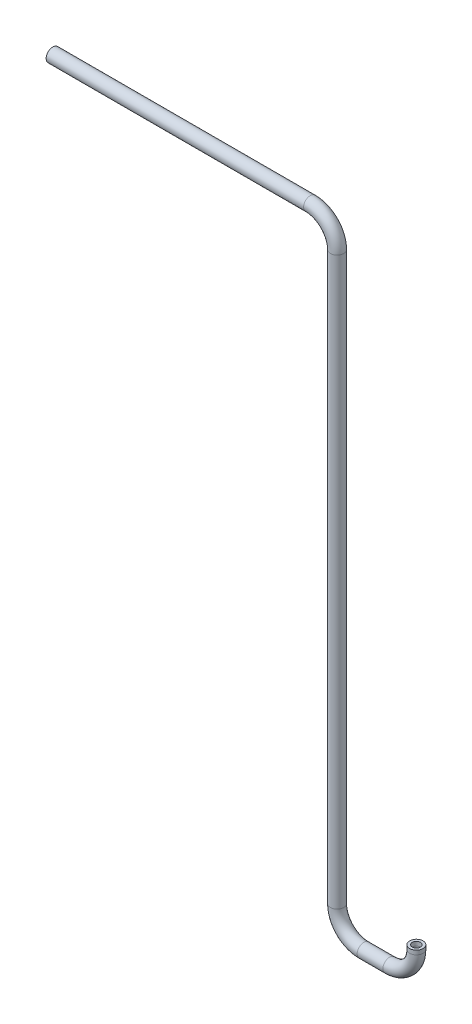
from build123d import *

# Parameters (mm, degrees)
ESQUISSE11_ON_SEGMENT_1_R                = 6.5
ESQUISSE11_ON_SEGMENT_1_R_2              = 4
TUBE_CIRCULAIRE_1_4_POUCE_8_13_1_DEPTH   = 250
ESQUISSE11_ON_SEGMENT_2_R                = 6.5
ESQUISSE11_ON_SEGMENT_2_R_2              = 4
TUBE_CIRCULAIRE_1_4_POUCE_8_13_1_2_ANGLE = 90
ESQUISSE11_ON_SEGMENT_3_R                = 6.5
ESQUISSE11_ON_SEGMENT_3_R_2              = 4
TUBE_CIRCULAIRE_1_4_POUCE_8_13_1_3_DEPTH = 550
ESQUISSE11_ON_SEGMENT_4_R                = 6.5
ESQUISSE11_ON_SEGMENT_4_R_2              = 4
TUBE_CIRCULAIRE_1_4_POUCE_8_13_1_4_ANGLE = 90
ESQUISSE11_R                             = 6.5
ESQUISSE11_R_2                           = 4
TUBE_CIRCULAIRE_1_4_POUCE_8_13_1_5_DEPTH = 25
ESQUISSE11_ON_SEGMENT_6_R                = 6.5
ESQUISSE11_ON_SEGMENT_6_R_2              = 4
TUBE_CIRCULAIRE_1_4_POUCE_8_13_1_6_ANGLE = 90
ESQUISSE11_ON_SEGMENT_7_R                = 6.5
ESQUISSE11_ON_SEGMENT_7_R_2              = 4
TUBE_CIRCULAIRE_1_4_POUCE_8_13_1_7_DEPTH = 4


with BuildPart() as part:
    # Esquisse11 on segment 1 (on carried to segment 1) → Tube circulaire 1.4 POUCE - 8-13_1 (new body)
    with BuildSketch(Plane(origin=(-301, 652, 0), x_dir=(0, 1, 0), z_dir=(1, 0, 0))):
        Circle(ESQUISSE11_ON_SEGMENT_1_R)
        Circle(ESQUISSE11_ON_SEGMENT_1_R_2, mode=Mode.SUBTRACT)
    extrude(amount=TUBE_CIRCULAIRE_1_4_POUCE_8_13_1_DEPTH)


with BuildPart() as body_2:
    # Esquisse11 on segment 2 (on carried to the start of arc 2) → Tube circulaire 1.4 POUCE - 8-13_1 2 (revolve)
    with BuildSketch(Plane(origin=(-25, 626, 0), x_dir=(-1, 0, 0), z_dir=(0, 1, 0))):
        Circle(ESQUISSE11_ON_SEGMENT_2_R)
        Circle(ESQUISSE11_ON_SEGMENT_2_R_2, mode=Mode.SUBTRACT)
    revolve(axis=Axis((-51, 626, 0), (0, 0, 1)), revolution_arc=TUBE_CIRCULAIRE_1_4_POUCE_8_13_1_2_ANGLE)


with BuildPart() as body_3:
    # Esquisse11 on segment 3 (on carried to segment 3) → Tube circulaire 1.4 POUCE - 8-13_1 3 (new body)
    with BuildSketch(Plane(origin=(-25, 76, 0), x_dir=(-1, 0, 0), z_dir=(0, 1, 0))):
        Circle(ESQUISSE11_ON_SEGMENT_3_R)
        Circle(ESQUISSE11_ON_SEGMENT_3_R_2, mode=Mode.SUBTRACT)
    extrude(amount=TUBE_CIRCULAIRE_1_4_POUCE_8_13_1_3_DEPTH)


with BuildPart() as body_4:
    # Esquisse11 on segment 4 (on carried to the start of arc 4) → Tube circulaire 1.4 POUCE - 8-13_1 4 (revolve)
    with BuildSketch(Plane(origin=(1, 50, 0), x_dir=(0, -1, 0), z_dir=(-1, 0, 0))):
        Circle(ESQUISSE11_ON_SEGMENT_4_R)
        Circle(ESQUISSE11_ON_SEGMENT_4_R_2, mode=Mode.SUBTRACT)
    revolve(axis=Axis((1, 76, 0), (0, 0, -1)), revolution_arc=TUBE_CIRCULAIRE_1_4_POUCE_8_13_1_4_ANGLE)


with BuildPart() as body_5:
    # Esquisse11 → Tube circulaire 1.4 POUCE - 8-13_1 5 (new body)
    with BuildSketch(Plane(origin=(1, 50, 0), x_dir=(0, 1, 0), z_dir=(1, 0, 0))):
        Circle(ESQUISSE11_R)
        Circle(ESQUISSE11_R_2, mode=Mode.SUBTRACT)
    extrude(amount=TUBE_CIRCULAIRE_1_4_POUCE_8_13_1_5_DEPTH)


with BuildPart() as body_6:
    # Esquisse11 on segment 6 (on carried to the start of arc 6) → Tube circulaire 1.4 POUCE - 8-13_1 6 (revolve)
    with BuildSketch(Plane(origin=(26, 50, 0), x_dir=(0, 1, 0), z_dir=(1, 0, 0))):
        Circle(ESQUISSE11_ON_SEGMENT_6_R)
        Circle(ESQUISSE11_ON_SEGMENT_6_R_2, mode=Mode.SUBTRACT)
    revolve(axis=Axis((26, 76, 0), (0, 0, 1)), revolution_arc=TUBE_CIRCULAIRE_1_4_POUCE_8_13_1_6_ANGLE)


with BuildPart() as body_7:
    # Esquisse11 on segment 7 (on carried to segment 7) → Tube circulaire 1.4 POUCE - 8-13_1 7 (new body)
    with BuildSketch(Plane(origin=(52, 76, 0), x_dir=(-1, 0, 0), z_dir=(0, 1, 0))):
        Circle(ESQUISSE11_ON_SEGMENT_7_R)
        Circle(ESQUISSE11_ON_SEGMENT_7_R_2, mode=Mode.SUBTRACT)
    extrude(amount=TUBE_CIRCULAIRE_1_4_POUCE_8_13_1_7_DEPTH)


solid = Compound([part.part, body_2.part, body_3.part, body_4.part, body_5.part, body_6.part, body_7.part])
